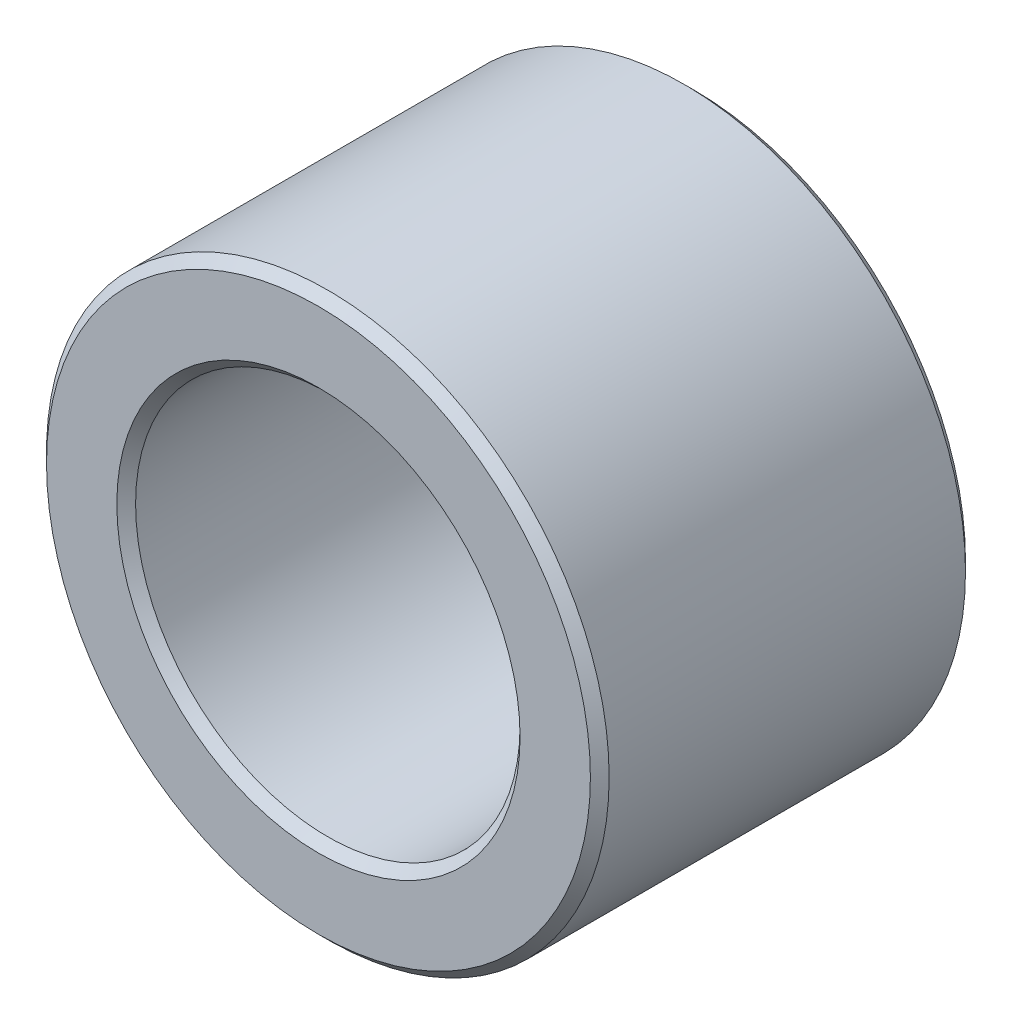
from build123d import *

# Parameters (mm, degrees)
SKETCH1_R           = 6
SKETCH1_R_2         = 4.1
BOSS_EXTRUDE2_DEPTH = 4
CHAMFER3_SIZE       = 0.2


with BuildPart() as part:
    # Sketch1 → Boss-Extrude2 (new, symmetric)
    with BuildSketch(Plane.XY):
        Circle(SKETCH1_R)
        Circle(SKETCH1_R_2, mode=Mode.SUBTRACT)
    extrude(amount=BOSS_EXTRUDE2_DEPTH, both=True)

    # Chamfer3
    chamfer3_edges = [part.edges().sort_by_distance(p)[0] for p in [
        (-6, 0, -4),
        (-6, 0, 4),
        (-4.1, 0, -4),
        (-4.1, 0, 4),
    ]]
    chamfer(chamfer3_edges, length=CHAMFER3_SIZE)


solid = part.part
